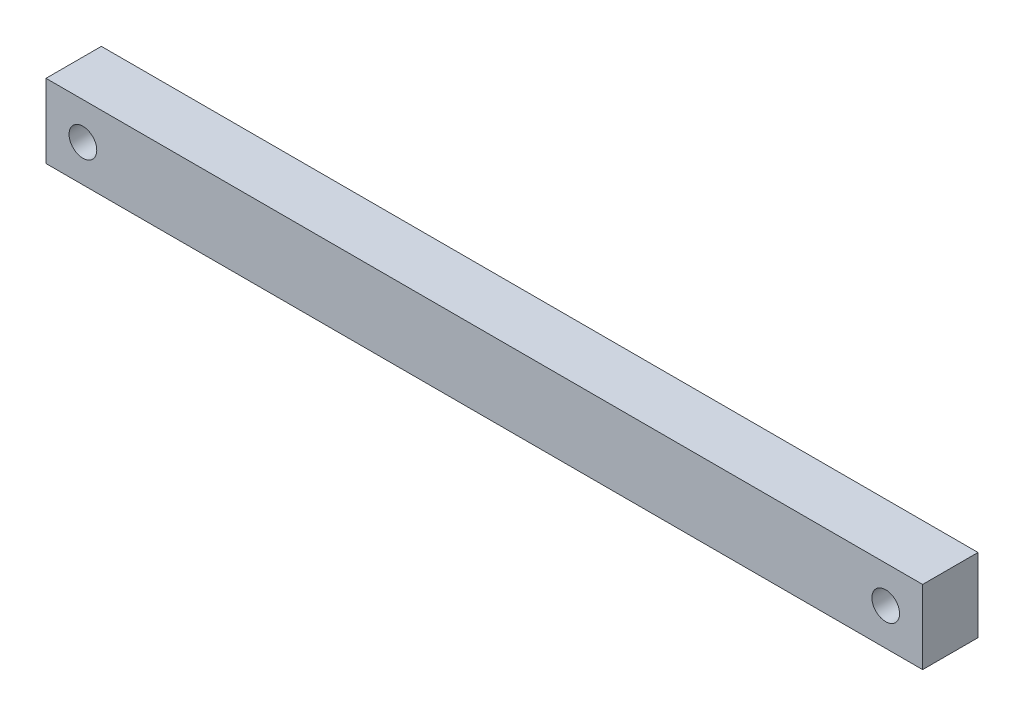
ISO-10303-21;
HEADER;
FILE_DESCRIPTION(('STEP AP214'),'2;1');
FILE_NAME('part.step','',(''),(''),'','','');
FILE_SCHEMA(('AUTOMOTIVE_DESIGN { 1 0 10303 214 1 1 1 1 }'));
ENDSEC;
DATA;
#1=APPLICATION_CONTEXT('core data for automotive mechanical design processes');
#2=APPLICATION_PROTOCOL_DEFINITION('international standard','automotive_design',2000,#1);
#3=PRODUCT_CONTEXT('',#1,'mechanical');
#4=PRODUCT('Part','Part','',(#3));
#5=PRODUCT_RELATED_PRODUCT_CATEGORY('part','',(#4));
#6=PRODUCT_DEFINITION_FORMATION('','',#4);
#7=PRODUCT_DEFINITION_CONTEXT('part definition',#1,'design');
#8=PRODUCT_DEFINITION('design','',#6,#7);
#9=PRODUCT_DEFINITION_SHAPE('','',#8);
#10=(LENGTH_UNIT() NAMED_UNIT(*) SI_UNIT(.MILLI.,.METRE.));
#11=(NAMED_UNIT(*) PLANE_ANGLE_UNIT() SI_UNIT($,.RADIAN.));
#12=(NAMED_UNIT(*) SI_UNIT($,.STERADIAN.) SOLID_ANGLE_UNIT());
#13=UNCERTAINTY_MEASURE_WITH_UNIT(LENGTH_MEASURE(1.E-05),#10,'distance_accuracy_value','');
#14=(GEOMETRIC_REPRESENTATION_CONTEXT(3) GLOBAL_UNCERTAINTY_ASSIGNED_CONTEXT((#13)) GLOBAL_UNIT_ASSIGNED_CONTEXT((#10,
#11,#12)) REPRESENTATION_CONTEXT('',''));
#15=CARTESIAN_POINT('',(0.,0.,0.));
#16=DIRECTION('',(0.,0.,1.));
#17=DIRECTION('',(1.,0.,0.));
#18=AXIS2_PLACEMENT_3D('',#15,#16,#17);
#19=CARTESIAN_POINT('',(-4.,-4.,6.));
#20=DIRECTION('',(0.,0.,1.));
#21=DIRECTION('',(1.,0.,0.));
#22=AXIS2_PLACEMENT_3D('',#19,#20,#21);
#23=PLANE('',#22);
#24=CARTESIAN_POINT('',(0.,0.,6.));
#25=DIRECTION('',(0.,0.,1.));
#26=DIRECTION('',(1.,0.,0.));
#27=AXIS2_PLACEMENT_3D('',#24,#25,#26);
#28=CIRCLE('',#27,1.5);
#29=CARTESIAN_POINT('',(1.5,0.,6.));
#30=VERTEX_POINT('',#29);
#31=EDGE_CURVE('E85',#30,#30,#28,.T.);
#32=ORIENTED_EDGE('',*,*,#31,.F.);
#33=EDGE_LOOP('',(#32));
#34=FACE_BOUND('',#33,.T.);
#35=DIRECTION('',(0.,-1.,0.));
#36=VECTOR('',#35,1.);
#37=CARTESIAN_POINT('',(-4.,3.99999999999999,6.));
#38=LINE('',#37,#36);
#39=CARTESIAN_POINT('',(-4.,3.99999999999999,6.));
#40=VERTEX_POINT('',#39);
#41=CARTESIAN_POINT('',(-4.,-4.,6.));
#42=VERTEX_POINT('',#41);
#43=EDGE_CURVE('E95',#40,#42,#38,.T.);
#44=ORIENTED_EDGE('',*,*,#43,.T.);
#45=DIRECTION('',(1.,0.,0.));
#46=VECTOR('',#45,1.);
#47=CARTESIAN_POINT('',(-4.,-4.,6.));
#48=LINE('',#47,#46);
#49=CARTESIAN_POINT('',(91.,-4.,6.));
#50=VERTEX_POINT('',#49);
#51=EDGE_CURVE('E80',#42,#50,#48,.T.);
#52=ORIENTED_EDGE('',*,*,#51,.T.);
#53=DIRECTION('',(0.,1.,0.));
#54=VECTOR('',#53,1.);
#55=CARTESIAN_POINT('',(91.,3.99999999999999,6.));
#56=LINE('',#55,#54);
#57=CARTESIAN_POINT('',(91.,3.99999999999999,6.));
#58=VERTEX_POINT('',#57);
#59=EDGE_CURVE('E46',#50,#58,#56,.T.);
#60=ORIENTED_EDGE('',*,*,#59,.T.);
#61=DIRECTION('',(-1.,0.,0.));
#62=VECTOR('',#61,1.);
#63=CARTESIAN_POINT('',(-4.,3.99999999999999,6.));
#64=LINE('',#63,#62);
#65=EDGE_CURVE('E41',#58,#40,#64,.T.);
#66=ORIENTED_EDGE('',*,*,#65,.T.);
#67=EDGE_LOOP('',(#44,#52,#60,#66));
#68=FACE_BOUND('',#67,.T.);
#69=CARTESIAN_POINT('',(87.,0.,6.));
#70=DIRECTION('',(0.,0.,1.));
#71=DIRECTION('',(1.,0.,0.));
#72=AXIS2_PLACEMENT_3D('',#69,#70,#71);
#73=CIRCLE('',#72,1.5);
#74=CARTESIAN_POINT('',(88.5,0.,6.));
#75=VERTEX_POINT('',#74);
#76=EDGE_CURVE('E113',#75,#75,#73,.T.);
#77=ORIENTED_EDGE('',*,*,#76,.F.);
#78=EDGE_LOOP('',(#77));
#79=FACE_BOUND('',#78,.T.);
#80=ADVANCED_FACE('F26',(#34,#68,#79),#23,.T.);
#81=CARTESIAN_POINT('',(-4.,-4.,0.));
#82=DIRECTION('',(0.,0.,1.));
#83=DIRECTION('',(1.,0.,0.));
#84=AXIS2_PLACEMENT_3D('',#81,#82,#83);
#85=PLANE('',#84);
#86=CARTESIAN_POINT('',(0.,0.,0.));
#87=DIRECTION('',(0.,0.,1.));
#88=DIRECTION('',(1.,0.,0.));
#89=AXIS2_PLACEMENT_3D('',#86,#87,#88);
#90=CIRCLE('',#89,1.5);
#91=CARTESIAN_POINT('',(1.5,0.,0.));
#92=VERTEX_POINT('',#91);
#93=EDGE_CURVE('E88',#92,#92,#90,.T.);
#94=ORIENTED_EDGE('',*,*,#93,.T.);
#95=EDGE_LOOP('',(#94));
#96=FACE_BOUND('',#95,.T.);
#97=DIRECTION('',(0.,-1.,0.));
#98=VECTOR('',#97,1.);
#99=CARTESIAN_POINT('',(-4.,3.99999999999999,0.));
#100=LINE('',#99,#98);
#101=CARTESIAN_POINT('',(-4.,3.99999999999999,0.));
#102=VERTEX_POINT('',#101);
#103=CARTESIAN_POINT('',(-4.,-4.,0.));
#104=VERTEX_POINT('',#103);
#105=EDGE_CURVE('E72',#102,#104,#100,.T.);
#106=ORIENTED_EDGE('',*,*,#105,.F.);
#107=DIRECTION('',(-1.,0.,0.));
#108=VECTOR('',#107,1.);
#109=CARTESIAN_POINT('',(-4.,3.99999999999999,0.));
#110=LINE('',#109,#108);
#111=CARTESIAN_POINT('',(91.,3.99999999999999,0.));
#112=VERTEX_POINT('',#111);
#113=EDGE_CURVE('E93',#112,#102,#110,.T.);
#114=ORIENTED_EDGE('',*,*,#113,.F.);
#115=DIRECTION('',(0.,1.,0.));
#116=VECTOR('',#115,1.);
#117=CARTESIAN_POINT('',(91.,3.99999999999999,0.));
#118=LINE('',#117,#116);
#119=CARTESIAN_POINT('',(91.,-4.,0.));
#120=VERTEX_POINT('',#119);
#121=EDGE_CURVE('E73',#120,#112,#118,.T.);
#122=ORIENTED_EDGE('',*,*,#121,.F.);
#123=DIRECTION('',(1.,0.,0.));
#124=VECTOR('',#123,1.);
#125=CARTESIAN_POINT('',(-4.,-4.,0.));
#126=LINE('',#125,#124);
#127=EDGE_CURVE('E67',#104,#120,#126,.T.);
#128=ORIENTED_EDGE('',*,*,#127,.F.);
#129=EDGE_LOOP('',(#106,#114,#122,#128));
#130=FACE_BOUND('',#129,.T.);
#131=CARTESIAN_POINT('',(87.,0.,0.));
#132=DIRECTION('',(0.,0.,1.));
#133=DIRECTION('',(1.,0.,0.));
#134=AXIS2_PLACEMENT_3D('',#131,#132,#133);
#135=CIRCLE('',#134,1.5);
#136=CARTESIAN_POINT('',(88.5,0.,0.));
#137=VERTEX_POINT('',#136);
#138=EDGE_CURVE('E115',#137,#137,#135,.T.);
#139=ORIENTED_EDGE('',*,*,#138,.T.);
#140=EDGE_LOOP('',(#139));
#141=FACE_BOUND('',#140,.T.);
#142=ADVANCED_FACE('F68',(#96,#130,#141),#85,.F.);
#143=CARTESIAN_POINT('',(-4.,3.99999999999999,6.));
#144=DIRECTION('',(1.,0.,0.));
#145=DIRECTION('',(0.,1.,0.));
#146=AXIS2_PLACEMENT_3D('',#143,#144,#145);
#147=PLANE('',#146);
#148=ORIENTED_EDGE('',*,*,#105,.T.);
#149=DIRECTION('',(0.,0.,-1.));
#150=VECTOR('',#149,1.);
#151=CARTESIAN_POINT('',(-4.,-4.,6.));
#152=LINE('',#151,#150);
#153=EDGE_CURVE('E11',#42,#104,#152,.T.);
#154=ORIENTED_EDGE('',*,*,#153,.F.);
#155=ORIENTED_EDGE('',*,*,#43,.F.);
#156=DIRECTION('',(0.,0.,-1.));
#157=VECTOR('',#156,1.);
#158=CARTESIAN_POINT('',(-4.,3.99999999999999,6.));
#159=LINE('',#158,#157);
#160=EDGE_CURVE('E84',#40,#102,#159,.T.);
#161=ORIENTED_EDGE('',*,*,#160,.T.);
#162=EDGE_LOOP('',(#148,#154,#155,#161));
#163=FACE_BOUND('',#162,.T.);
#164=ADVANCED_FACE('F28',(#163),#147,.F.);
#165=CARTESIAN_POINT('',(-4.,-4.,6.));
#166=DIRECTION('',(0.,1.,0.));
#167=DIRECTION('',(0.,0.,1.));
#168=AXIS2_PLACEMENT_3D('',#165,#166,#167);
#169=PLANE('',#168);
#170=ORIENTED_EDGE('',*,*,#127,.T.);
#171=DIRECTION('',(0.,0.,-1.));
#172=VECTOR('',#171,1.);
#173=CARTESIAN_POINT('',(91.,-4.,6.));
#174=LINE('',#173,#172);
#175=EDGE_CURVE('E34',#50,#120,#174,.T.);
#176=ORIENTED_EDGE('',*,*,#175,.F.);
#177=ORIENTED_EDGE('',*,*,#51,.F.);
#178=ORIENTED_EDGE('',*,*,#153,.T.);
#179=EDGE_LOOP('',(#170,#176,#177,#178));
#180=FACE_BOUND('',#179,.T.);
#181=ADVANCED_FACE('F79',(#180),#169,.F.);
#182=CARTESIAN_POINT('',(91.,3.99999999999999,6.));
#183=DIRECTION('',(-1.,0.,0.));
#184=DIRECTION('',(0.,0.,1.));
#185=AXIS2_PLACEMENT_3D('',#182,#183,#184);
#186=PLANE('',#185);
#187=ORIENTED_EDGE('',*,*,#121,.T.);
#188=DIRECTION('',(0.,0.,-1.));
#189=VECTOR('',#188,1.);
#190=CARTESIAN_POINT('',(91.,3.99999999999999,6.));
#191=LINE('',#190,#189);
#192=EDGE_CURVE('E101',#58,#112,#191,.T.);
#193=ORIENTED_EDGE('',*,*,#192,.F.);
#194=ORIENTED_EDGE('',*,*,#59,.F.);
#195=ORIENTED_EDGE('',*,*,#175,.T.);
#196=EDGE_LOOP('',(#187,#193,#194,#195));
#197=FACE_BOUND('',#196,.T.);
#198=ADVANCED_FACE('F104',(#197),#186,.F.);
#199=CARTESIAN_POINT('',(-4.,3.99999999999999,6.));
#200=DIRECTION('',(0.,-1.,0.));
#201=DIRECTION('',(0.,0.,-1.));
#202=AXIS2_PLACEMENT_3D('',#199,#200,#201);
#203=PLANE('',#202);
#204=ORIENTED_EDGE('',*,*,#113,.T.);
#205=ORIENTED_EDGE('',*,*,#160,.F.);
#206=ORIENTED_EDGE('',*,*,#65,.F.);
#207=ORIENTED_EDGE('',*,*,#192,.T.);
#208=EDGE_LOOP('',(#204,#205,#206,#207));
#209=FACE_BOUND('',#208,.T.);
#210=ADVANCED_FACE('F106',(#209),#203,.F.);
#211=CARTESIAN_POINT('',(0.,0.,6.));
#212=DIRECTION('',(0.,0.,-1.));
#213=DIRECTION('',(-1.,0.,0.));
#214=AXIS2_PLACEMENT_3D('',#211,#212,#213);
#215=CYLINDRICAL_SURFACE('',#214,1.5);
#216=ORIENTED_EDGE('',*,*,#31,.T.);
#217=EDGE_LOOP('',(#216));
#218=FACE_BOUND('',#217,.T.);
#219=ORIENTED_EDGE('',*,*,#93,.F.);
#220=EDGE_LOOP('',(#219));
#221=FACE_BOUND('',#220,.T.);
#222=ADVANCED_FACE('F124',(#218,#221),#215,.F.);
#223=CARTESIAN_POINT('',(87.,0.,6.));
#224=DIRECTION('',(0.,0.,-1.));
#225=DIRECTION('',(-1.,0.,0.));
#226=AXIS2_PLACEMENT_3D('',#223,#224,#225);
#227=CYLINDRICAL_SURFACE('',#226,1.5);
#228=ORIENTED_EDGE('',*,*,#76,.T.);
#229=EDGE_LOOP('',(#228));
#230=FACE_BOUND('',#229,.T.);
#231=ORIENTED_EDGE('',*,*,#138,.F.);
#232=EDGE_LOOP('',(#231));
#233=FACE_BOUND('',#232,.T.);
#234=ADVANCED_FACE('F122',(#230,#233),#227,.F.);
#235=CLOSED_SHELL('',(#80,#142,#164,#181,#198,#210,#222,#234));
#236=MANIFOLD_SOLID_BREP('B2',#235);
#237=ADVANCED_BREP_SHAPE_REPRESENTATION('',(#18,#236),#14);
#238=SHAPE_DEFINITION_REPRESENTATION(#9,#237);
ENDSEC;
END-ISO-10303-21;
